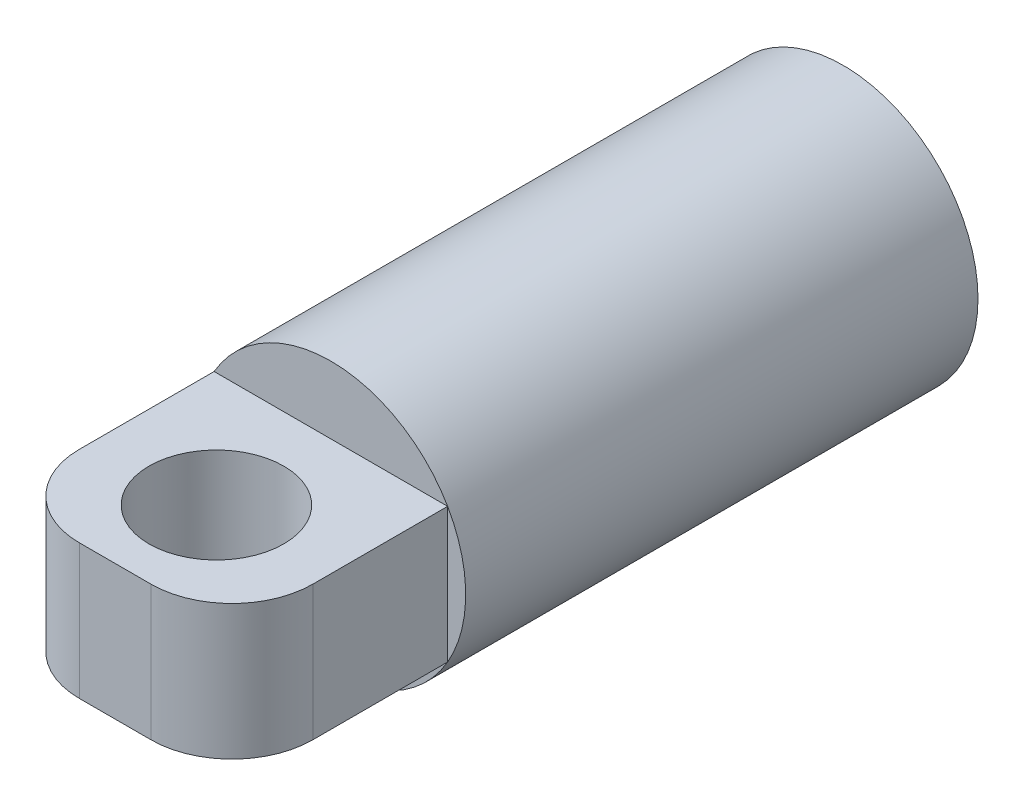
from build123d import *

# Parameters (mm, degrees)
SKETCH1_R           = 5
BOSS_EXTRUDE1_DEPTH = 27
SKETCH2_OUTSIDE_W   = 18.096
SKETCH2_OUTSIDE_H   = 18.096
SKETCH2_OUTSIDE_W_2 = 8.660254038
SKETCH2_OUTSIDE_H_2 = 5
CUT_EXTRUDE1_DEPTH  = 8
FILLET2_R           = 3
SKETCH4_R           = 2.5
CUT_EXTRUDE2_DEPTH  = 8


with BuildPart() as part:
    # Sketch1 → Boss-Extrude1 (new body)
    with BuildSketch(Plane.XY):
        Circle(SKETCH1_R)
    extrude(amount=BOSS_EXTRUDE1_DEPTH)

    # Sketch2 outside → Cut-Extrude1 (cut)
    with BuildSketch(Plane.XY.offset(27)):
        Rectangle(SKETCH2_OUTSIDE_W, SKETCH2_OUTSIDE_H)
        Rectangle(SKETCH2_OUTSIDE_W_2, SKETCH2_OUTSIDE_H_2, mode=Mode.SUBTRACT)
    extrude(amount=-CUT_EXTRUDE1_DEPTH, mode=Mode.SUBTRACT)

    # Fillet2
    fillet2_edges = [part.edges().sort_by_distance(p)[0] for p in [
        (4.330127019, 0, 27),
        (-4.330127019, 0, 27),
    ]]
    fillet(fillet2_edges, radius=FILLET2_R)

    # Sketch4 → Cut-Extrude2 (cut)
    with BuildSketch(Plane.XZ.offset(2.5)):
        with Locations(Location((0, 23.245088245, 0), (0, 0, 270))):
            Circle(SKETCH4_R)
    extrude(amount=-CUT_EXTRUDE2_DEPTH, mode=Mode.SUBTRACT)


solid = part.part
